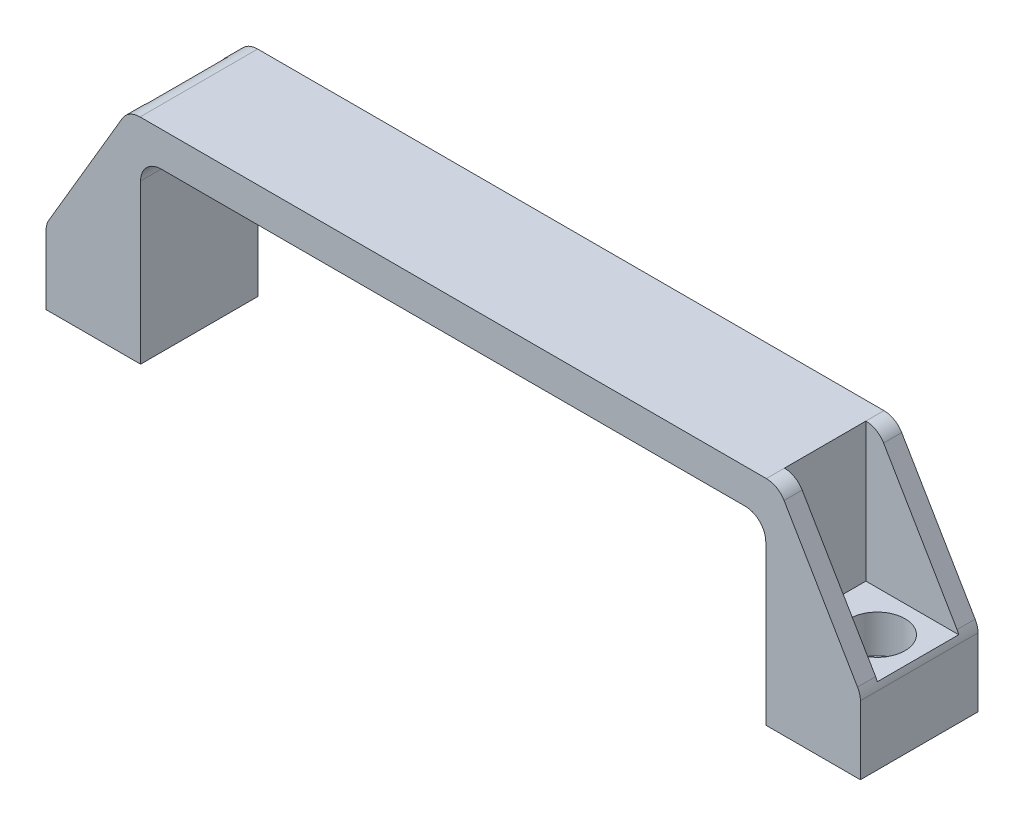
from build123d import *

# Parameters (mm, degrees)
EXTRUSION1_DEPTH = 28.6
CONG_1_R         = 5
CONG_2_R         = 5
CONG_3_R         = 5
CONG_4_R         = 5
ESQUISSE2_W      = 22.859730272
ESQUISSE2_H      = 19.8
ESQUISSE2_W_2    = 20
EXTRUSION2_DEPTH = 33.7
ESQUISSE3_R      = 4.1
EXTRUSION5_DEPTH = 207.702588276
ESQUISSE4_R      = 6.75
EXTRUSION6_DEPTH = 9.2


with BuildPart() as part:
    # Esquisse1 → Extrusion1 (new body)
    with BuildSketch(Plane.XY):
        Polygon((0, 0), (23, 0), (23, 43.6), (175, 43.6), (175, 0), (198, 0), (198, 18), (178, 52), (20, 52), (0, 18), align=None)
    extrude(amount=EXTRUSION1_DEPTH)

    # Cong_1
    cong_1_edges = [part.edges().sort_by_distance(p)[0] for p in [
        (178, 52, 14.3),
    ]]
    fillet(cong_1_edges, radius=CONG_1_R)

    # Cong_2
    cong_2_edges = [part.edges().sort_by_distance(p)[0] for p in [
        (20, 52, 14.3),
    ]]
    fillet(cong_2_edges, radius=CONG_2_R)

    # Cong_3
    cong_3_edges = [part.edges().sort_by_distance(p)[0] for p in [
        (175, 43.6, 14.3),
        (23, 43.6, 14.3),
    ]]
    fillet(cong_3_edges, radius=CONG_3_R)

    # Cong_4
    cong_4_edges = [part.edges().sort_by_distance(p)[0] for p in [
        (0, 18, 14.3),
        (198, 18, 14.3),
    ]]
    fillet(cong_4_edges, radius=CONG_4_R)

    # Esquisse2 → Extrusion2 (cut)
    with BuildSketch(Plane(origin=(0, 52, 0), x_dir=(1, 0, 0), z_dir=(0, 1, 0))):
        with Locations((186.570134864, -14.3)):
            Rectangle(ESQUISSE2_W, ESQUISSE2_H)
        with Locations((10, -14.3)):
            Rectangle(ESQUISSE2_W_2, ESQUISSE2_H)
    extrude(amount=-EXTRUSION2_DEPTH, mode=Mode.SUBTRACT)

    # Esquisse3 → Extrusion5 (cut, through all)
    with BuildSketch(Plane(origin=(0, 52, 0), x_dir=(1, 0, 0), z_dir=(0, 1, 0))):
        with Locations(Location((10.2, -14.3, 0), (0, 0, 180))):
            Circle(ESQUISSE3_R)
        with Locations(Location((187.8, -14.3, 0), (0, 0, 180))):
            Circle(ESQUISSE3_R)
    extrude(amount=-EXTRUSION5_DEPTH, mode=Mode.SUBTRACT)

    # Esquisse4 → Extrusion6 (cut)
    with BuildSketch(Plane(origin=(0, 18.3, 0), x_dir=(1, 0, 0), z_dir=(0, 1, 0))):
        with Locations(Location((10.2, -14.3, 0), (0, 0, 180))):
            Circle(ESQUISSE4_R)
        with Locations(Location((187.8, -14.3, 0), (0, 0, 180))):
            Circle(ESQUISSE4_R)
    extrude(amount=-EXTRUSION6_DEPTH, mode=Mode.SUBTRACT)


solid = part.part
